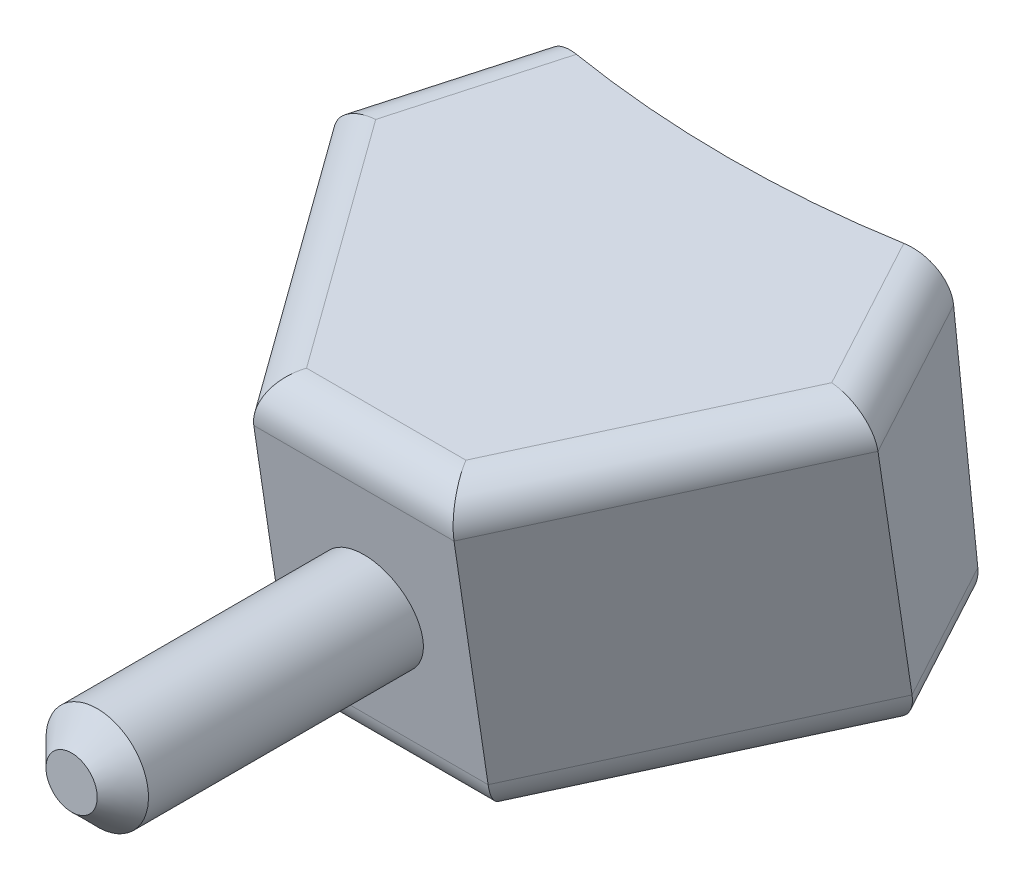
from build123d import *

# Parameters (mm, degrees)
EXTRUSION1_DEPTH = 6
EXTRUSION2_REACH = 17.606
ESQUISSE2_R      = 1
D_POUILLE1_ANGLE = -5
CONG_1_R         = 0.75
CONG_2_R         = 0.75
CHANFREIN1_SIZE  = 0.5


with BuildPart() as part:
    # Esquisse1 → Extrusion1 (new body)
    with BuildSketch(Plane(origin=(0, 3.040140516, 0.454352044), x_dir=(-1, 0, 0), z_dir=(0, 0.9890158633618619, 0.14780941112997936))):
        with BuildLine():
            Line((-5.309208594, -5.01016589), (-3.963556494, -7.895926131))
            ThreePointArc((-3.963556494, -7.895926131), (0, -7.535940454), (3.963556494, -7.895926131))
            Line((3.963556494, -7.895926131), (5.309208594, -5.01016589))
            Line((5.309208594, -5.01016589), (1.954051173, -0.035940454))
            Line((1.954051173, -0.035940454), (-1.954051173, -0.035940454))
            Line((-1.954051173, -0.035940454), (-5.309208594, -5.01016589))
        make_face()
    extrude(amount=-EXTRUSION1_DEPTH)

    # Extrusion2: up to this plane
    extrusion2_end = Plane(origin=(-1.954051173, -2.888642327, -0.468050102), z_dir=(0, -0.14780941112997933, 0.9890158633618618))
    # Esquisse2 → Extrusion2 (add, up to the surface)
    with BuildSketch(Plane.XY.offset(5.817709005), mode=Mode.PRIVATE) as extrusion2_sk1:
        with Locations(Location((0, 0, 0), (0, 0, 90))):
            Circle(ESQUISSE2_R)
    extrusion2_tool1 = split(extrude(extrusion2_sk1.sketch, amount=-EXTRUSION2_REACH, mode=Mode.PRIVATE), bisect_by=extrusion2_end, keep=Keep.BOTH, mode=Mode.PRIVATE)
    add(extrusion2_tool1.solids().sort_by_distance((0, 0, 5.817709))[0])

    # D_pouille1
    d_pouille1_faces = [part.faces().sort_by_distance(p)[0] for p in [
        (0, 1.186975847, -7.442240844),
    ]]
    draft(d_pouille1_faces, Plane(origin=(0, 7.405830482, -28.757161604), x_dir=(0, -0.14780941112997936, 0.9890158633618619), z_dir=(0, 0.9890158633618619, 0.14780941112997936)), D_POUILLE1_ANGLE)

    # Cong_1
    cong_1_edges = [part.edges().sort_by_distance(p)[0] for p in [
        (4.750926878, -1.976441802, -6.571726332),
        (3.631629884, -2.52102366, -2.927844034),
        (0, -2.888642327, -0.468050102),
        (-3.631629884, -2.52102366, -2.927844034),
        (-4.750926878, -1.976441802, -6.571726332),
    ]]
    fillet(cong_1_edges, radius=CONG_1_R)

    # Cong_2
    cong_2_edges = [part.edges().sort_by_distance(p)[0] for p in [
        (0, 3.045452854, 0.418806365),
        (-3.631629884, 3.41307152, -2.040987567),
        (-4.636382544, 3.993961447, -5.927812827),
        (4.636382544, 3.993961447, -5.927812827),
        (3.631629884, 3.41307152, -2.040987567),
    ]]
    fillet(cong_2_edges, radius=CONG_2_R)

    # Chanfrein1
    chanfrein1_edges = [part.edges().sort_by_distance(p)[0] for p in [
        (0, -1, 5.817709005),
    ]]
    chamfer(chanfrein1_edges, length=CHANFREIN1_SIZE)


solid = part.part
